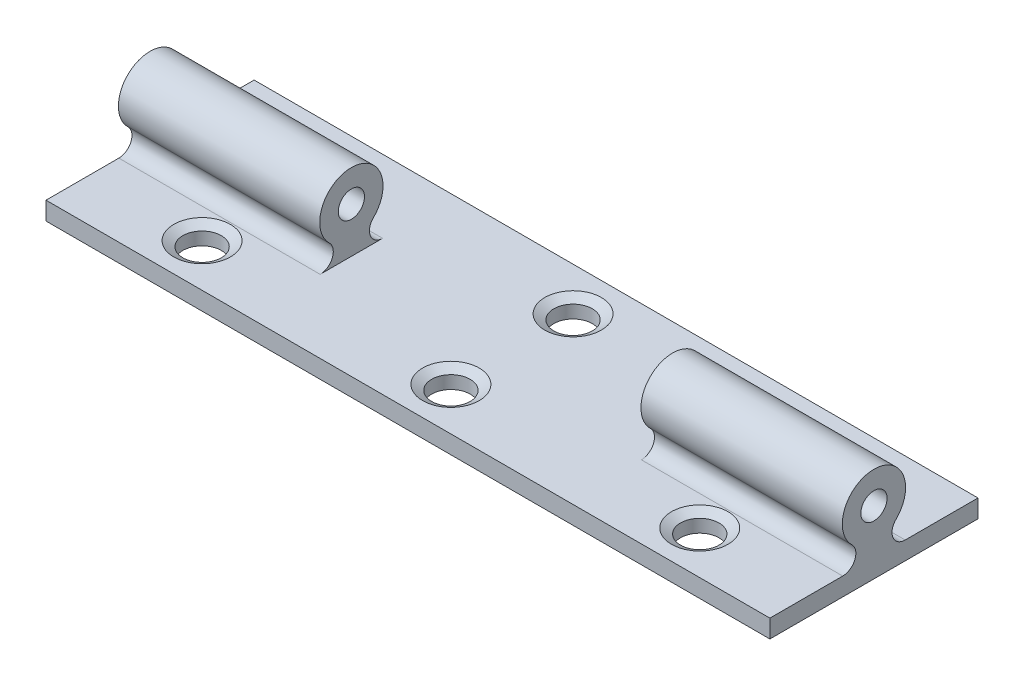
ISO-10303-21;
HEADER;
FILE_DESCRIPTION(('STEP AP214'),'2;1');
FILE_NAME('part.step','',(''),(''),'','','');
FILE_SCHEMA(('AUTOMOTIVE_DESIGN { 1 0 10303 214 1 1 1 1 }'));
ENDSEC;
DATA;
#1=APPLICATION_CONTEXT('core data for automotive mechanical design processes');
#2=APPLICATION_PROTOCOL_DEFINITION('international standard','automotive_design',2000,#1);
#3=PRODUCT_CONTEXT('',#1,'mechanical');
#4=PRODUCT('Part','Part','',(#3));
#5=PRODUCT_RELATED_PRODUCT_CATEGORY('part','',(#4));
#6=PRODUCT_DEFINITION_FORMATION('','',#4);
#7=PRODUCT_DEFINITION_CONTEXT('part definition',#1,'design');
#8=PRODUCT_DEFINITION('design','',#6,#7);
#9=PRODUCT_DEFINITION_SHAPE('','',#8);
#10=(LENGTH_UNIT() NAMED_UNIT(*) SI_UNIT(.MILLI.,.METRE.));
#11=(NAMED_UNIT(*) PLANE_ANGLE_UNIT() SI_UNIT($,.RADIAN.));
#12=(NAMED_UNIT(*) SI_UNIT($,.STERADIAN.) SOLID_ANGLE_UNIT());
#13=UNCERTAINTY_MEASURE_WITH_UNIT(LENGTH_MEASURE(1.E-05),#10,'distance_accuracy_value','');
#14=(GEOMETRIC_REPRESENTATION_CONTEXT(3) GLOBAL_UNCERTAINTY_ASSIGNED_CONTEXT((#13)) GLOBAL_UNIT_ASSIGNED_CONTEXT((#10,
#11,#12)) REPRESENTATION_CONTEXT('',''));
#15=CARTESIAN_POINT('',(0.,0.,0.));
#16=DIRECTION('',(0.,0.,1.));
#17=DIRECTION('',(1.,0.,0.));
#18=AXIS2_PLACEMENT_3D('',#15,#16,#17);
#19=CARTESIAN_POINT('',(-44.45,2.,-3.45024753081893));
#20=CARTESIAN_POINT('',(-42.9666666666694,2.,-3.45024753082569));
#21=CARTESIAN_POINT('',(-41.4833333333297,2.,-3.45024753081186));
#22=CARTESIAN_POINT('',(-32.5833333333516,2.,-3.45024753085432));
#23=CARTESIAN_POINT('',(-25.1666666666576,2.,-3.45024753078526));
#24=CARTESIAN_POINT('',(-10.3333333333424,2.,-3.45024753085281));
#25=CARTESIAN_POINT('',(-2.91666666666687,2.,-3.45024753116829));
#26=CARTESIAN_POINT('',(5.98333333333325,2.,-3.4502475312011));
#27=CARTESIAN_POINT('',(7.46666666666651,2.,-3.45024753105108));
#28=CARTESIAN_POINT('',(8.94999999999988,2.,-3.45024753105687));
#29=CARTESIAN_POINT('',(-44.45,2.,-1.91645860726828));
#30=CARTESIAN_POINT('',(-42.9666666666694,1.99999999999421,-1.91645860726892));
#31=CARTESIAN_POINT('',(-41.4833333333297,2.00000000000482,-1.91645860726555));
#32=CARTESIAN_POINT('',(-32.5833333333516,1.99999999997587,-1.91645860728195));
#33=CARTESIAN_POINT('',(-25.1666666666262,2.00000000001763,-1.91645860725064));
#34=CARTESIAN_POINT('',(-10.333333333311,1.99999999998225,-1.91645860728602));
#35=CARTESIAN_POINT('',(-2.9166666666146,1.99999999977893,-1.91645860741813));
#36=CARTESIAN_POINT('',(5.98333333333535,1.99999999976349,-1.91645860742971));
#37=CARTESIAN_POINT('',(7.46666666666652,1.99999999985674,-1.91645860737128));
#38=CARTESIAN_POINT('',(8.94999999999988,1.99999999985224,-1.91645860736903));
#39=CARTESIAN_POINT('',(-44.45,3.42117187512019,-1.33958863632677));
#40=CARTESIAN_POINT('',(-42.9666666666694,3.42117187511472,-1.33958863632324));
#41=CARTESIAN_POINT('',(-41.4833333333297,3.42117187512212,-1.33958863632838));
#42=CARTESIAN_POINT('',(-32.5833333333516,3.42117187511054,-1.33958863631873));
#43=CARTESIAN_POINT('',(-25.1666666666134,3.42117187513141,-1.33958863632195));
#44=CARTESIAN_POINT('',(-10.3333333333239,3.4211718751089,-1.3395886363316));
#45=CARTESIAN_POINT('',(-2.91666666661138,3.42117187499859,-1.33958863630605));
#46=CARTESIAN_POINT('',(5.9833333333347,3.42117187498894,-1.33958863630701));
#47=CARTESIAN_POINT('',(7.466666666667,3.42117187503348,-1.33958863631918));
#48=CARTESIAN_POINT('',(8.94999999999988,3.4211718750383,-1.3395886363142));
#49=CARTESIAN_POINT('',(-44.45,4.49019951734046,-2.43944697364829));
#50=CARTESIAN_POINT('',(-42.9666666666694,4.49019951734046,-2.43944697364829));
#51=CARTESIAN_POINT('',(-41.4833333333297,4.49019951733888,-2.43944697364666));
#52=CARTESIAN_POINT('',(-32.5833333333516,4.49019951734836,-2.43944697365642));
#53=CARTESIAN_POINT('',(-25.1666666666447,4.49019951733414,-2.43944697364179));
#54=CARTESIAN_POINT('',(-10.3333333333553,4.49019951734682,-2.43944697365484));
#55=CARTESIAN_POINT('',(-2.91666666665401,4.49019951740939,-2.43944697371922));
#56=CARTESIAN_POINT('',(5.98333333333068,4.4901995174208,-2.43944697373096));
#57=CARTESIAN_POINT('',(7.46666666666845,4.49019951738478,-2.4394469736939));
#58=CARTESIAN_POINT('',(8.94999999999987,4.49019951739,-2.43944697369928));
#59=(BOUNDED_SURFACE() B_SPLINE_SURFACE(3,3,((#19,#20,#21,#22,#23,#24,#25,#26,#27,#28),(#29,#30,
#31,#32,#33,#34,#35,#36,#37,#38),(#39,#40,#41,#42,#43,#44,#45,#46,#47,#48),(#49,#50,#51,#52,#53,
#54,#55,#56,#57,#58)),.UNSPECIFIED.,.F.,.F.,.F.) B_SPLINE_SURFACE_WITH_KNOTS((4,4),(4,2,2,2,4),
(0.,1.),(-0.199999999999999,0.,0.999999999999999,2.,2.2),
.UNSPECIFIED.) GEOMETRIC_REPRESENTATION_ITEM() RATIONAL_B_SPLINE_SURFACE(((1.,1.,1.,1.,1.,1.,1.,
1.,1.,1.),(0.584071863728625,0.584071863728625,0.584071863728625,0.584071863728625,
0.584071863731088,0.584071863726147,0.584071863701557,0.584071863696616,0.584071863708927,
0.584071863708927),(0.584071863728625,0.584071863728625,0.584071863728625,0.584071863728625,
0.584071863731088,0.584071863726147,0.584071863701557,0.584071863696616,0.584071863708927,
0.584071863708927),(1.,1.,1.,1.,1.,1.,1.,1.,1.,1.))) REPRESENTATION_ITEM('') SURFACE());
#60=CARTESIAN_POINT('',(8.94999999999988,2.,-3.45024753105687));
#61=CARTESIAN_POINT('',(7.46666666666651,2.,-3.45024753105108));
#62=CARTESIAN_POINT('',(5.98333333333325,2.,-3.4502475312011));
#63=CARTESIAN_POINT('',(-2.91666666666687,2.,-3.45024753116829));
#64=CARTESIAN_POINT('',(-10.3333333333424,2.,-3.45024753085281));
#65=CARTESIAN_POINT('',(-25.1666666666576,2.,-3.45024753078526));
#66=CARTESIAN_POINT('',(-32.5833333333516,2.,-3.45024753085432));
#67=CARTESIAN_POINT('',(-41.4833333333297,2.,-3.45024753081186));
#68=CARTESIAN_POINT('',(-42.9666666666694,2.,-3.45024753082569));
#69=CARTESIAN_POINT('',(-44.45,2.,-3.45024753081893));
#70=(BOUNDED_CURVE() B_SPLINE_CURVE(3,(#60,#61,#62,#63,#64,#65,#66,#67,#68,#69),.UNSPECIFIED.,
.F.,.F.) B_SPLINE_CURVE_WITH_KNOTS((4,2,2,2,4),(-0.199999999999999,0.,1.,2.,2.2),
.UNSPECIFIED.) CURVE() GEOMETRIC_REPRESENTATION_ITEM() RATIONAL_B_SPLINE_CURVE((1.,1.,1.,1.,1.,
1.,1.,1.,1.,1.)) REPRESENTATION_ITEM(''));
#71=CARTESIAN_POINT('',(-40.,2.,-3.45024753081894));
#72=VERTEX_POINT('',#71);
#73=CARTESIAN_POINT('',(-17.75,2.,-3.45024753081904));
#74=VERTEX_POINT('',#73);
#75=EDGE_CURVE('E193',#72,#74,#70,.F.);
#76=CARTESIAN_POINT('',(-40.,2.,-3.45024753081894));
#77=CARTESIAN_POINT('',(-40.,2.,-1.91645860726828));
#78=CARTESIAN_POINT('',(-40.,3.42117187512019,-1.33958863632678));
#79=CARTESIAN_POINT('',(-40.,4.49019951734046,-2.43944697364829));
#80=(BOUNDED_CURVE() B_SPLINE_CURVE(3,(#76,#77,#78,#79),.UNSPECIFIED.,.F.,
.F.) B_SPLINE_CURVE_WITH_KNOTS((4,4),(0.,1.),
.UNSPECIFIED.) CURVE() GEOMETRIC_REPRESENTATION_ITEM() RATIONAL_B_SPLINE_CURVE((1.,
0.584071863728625,0.584071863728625,1.)) REPRESENTATION_ITEM(''));
#81=CARTESIAN_POINT('',(-40.,4.49019951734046,-2.43944697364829));
#82=VERTEX_POINT('',#81);
#83=EDGE_CURVE('E59',#72,#82,#80,.T.);
#84=CARTESIAN_POINT('',(-44.45,4.49019951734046,-2.43944697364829));
#85=CARTESIAN_POINT('',(-42.9666666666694,4.49019951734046,-2.43944697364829));
#86=CARTESIAN_POINT('',(-41.4833333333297,4.49019951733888,-2.43944697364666));
#87=CARTESIAN_POINT('',(-32.5833333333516,4.49019951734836,-2.43944697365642));
#88=CARTESIAN_POINT('',(-25.1666666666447,4.49019951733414,-2.43944697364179));
#89=CARTESIAN_POINT('',(-10.3333333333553,4.49019951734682,-2.43944697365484));
#90=CARTESIAN_POINT('',(-2.91666666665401,4.49019951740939,-2.43944697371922));
#91=CARTESIAN_POINT('',(5.98333333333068,4.4901995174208,-2.43944697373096));
#92=CARTESIAN_POINT('',(7.46666666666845,4.49019951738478,-2.4394469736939));
#93=CARTESIAN_POINT('',(8.94999999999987,4.49019951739,-2.43944697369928));
#94=(BOUNDED_CURVE() B_SPLINE_CURVE(3,(#84,#85,#86,#87,#88,#89,#90,#91,#92,#93),.UNSPECIFIED.,
.F.,.F.) B_SPLINE_CURVE_WITH_KNOTS((4,2,2,2,4),(-0.199999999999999,0.,0.999999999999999,2.,2.2),
.UNSPECIFIED.) CURVE() GEOMETRIC_REPRESENTATION_ITEM() RATIONAL_B_SPLINE_CURVE((1.,1.,1.,1.,1.,
1.,1.,1.,1.,1.)) REPRESENTATION_ITEM(''));
#95=CARTESIAN_POINT('',(-17.75,4.49019951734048,-2.43944697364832));
#96=VERTEX_POINT('',#95);
#97=EDGE_CURVE('E860',#96,#82,#94,.F.);
#98=CARTESIAN_POINT('',(-17.75,4.49019951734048,-2.43944697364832));
#99=CARTESIAN_POINT('',(-17.75,3.42117187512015,-1.33958863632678));
#100=CARTESIAN_POINT('',(-17.75,1.99999999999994,-1.91645860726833));
#101=CARTESIAN_POINT('',(-17.75,2.,-3.45024753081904));
#102=(BOUNDED_CURVE() B_SPLINE_CURVE(3,(#98,#99,#100,#101),.UNSPECIFIED.,.F.,
.F.) B_SPLINE_CURVE_WITH_KNOTS((4,4),(0.,1.),
.UNSPECIFIED.) CURVE() GEOMETRIC_REPRESENTATION_ITEM() RATIONAL_B_SPLINE_CURVE((1.,
0.584071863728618,0.584071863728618,1.)) REPRESENTATION_ITEM(''));
#103=EDGE_CURVE('E51',#74,#96,#102,.F.);
#104=ORIENTED_EDGE('',*,*,#75,.F.);
#105=ORIENTED_EDGE('',*,*,#83,.T.);
#106=ORIENTED_EDGE('',*,*,#97,.F.);
#107=ORIENTED_EDGE('',*,*,#103,.F.);
#108=EDGE_LOOP('',(#104,#105,#106,#107));
#109=FACE_BOUND('',#108,.T.);
#110=ADVANCED_FACE('F35',(#109),#59,.T.);
#111=CARTESIAN_POINT('',(-8.95000000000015,2.,-3.45024753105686));
#112=CARTESIAN_POINT('',(-7.46666666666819,2.,-3.45024753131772));
#113=CARTESIAN_POINT('',(-5.98333333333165,2.,-3.45024753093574));
#114=CARTESIAN_POINT('',(2.91666666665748,2.,-3.45024753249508));
#115=CARTESIAN_POINT('',(10.333333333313,2.,-3.45024752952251));
#116=CARTESIAN_POINT('',(25.166666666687,2.,-3.45024753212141));
#117=CARTESIAN_POINT('',(32.5833333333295,2.,-3.45024754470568));
#118=CARTESIAN_POINT('',(41.4833333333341,2.,-3.45024754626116));
#119=CARTESIAN_POINT('',(42.9666666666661,2.,-3.45024754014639));
#120=CARTESIAN_POINT('',(44.45,2.,-3.45024754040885));
#121=CARTESIAN_POINT('',(-8.95000000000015,1.99999999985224,-1.91645860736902));
#122=CARTESIAN_POINT('',(-7.46666666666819,1.99999999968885,-1.91645860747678));
#123=CARTESIAN_POINT('',(-5.98333333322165,1.99999999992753,-1.9164586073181));
#124=CARTESIAN_POINT('',(2.91666666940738,1.99999999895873,-1.91645860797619));
#125=CARTESIAN_POINT('',(10.3333333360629,2.00000000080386,-1.91645860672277));
#126=CARTESIAN_POINT('',(25.1666666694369,1.99999999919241,-1.91645860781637));
#127=CARTESIAN_POINT('',(32.5833333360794,1.99999999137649,-1.91645861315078));
#128=CARTESIAN_POINT('',(41.4833333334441,1.99999999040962,-1.91645861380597));
#129=CARTESIAN_POINT('',(42.9666666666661,1.99999999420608,-1.91645861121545));
#130=CARTESIAN_POINT('',(44.45,1.99999999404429,-1.91645861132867));
#131=CARTESIAN_POINT('',(-8.95000000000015,3.4211718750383,-1.33958863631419));
#132=CARTESIAN_POINT('',(-7.46666666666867,3.42117187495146,-1.33958863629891));
#133=CARTESIAN_POINT('',(-5.98333333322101,3.421171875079,-1.33958863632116));
#134=CARTESIAN_POINT('',(2.91666666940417,3.42117187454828,-1.33958863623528));
#135=CARTESIAN_POINT('',(10.3333333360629,3.42117187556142,-1.3395886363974));
#136=CARTESIAN_POINT('',(25.1666666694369,3.42117187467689,-1.33958863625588));
#137=CARTESIAN_POINT('',(32.5833333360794,3.4211718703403,-1.33958863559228));
#138=CARTESIAN_POINT('',(41.4833333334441,3.42117186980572,-1.3395886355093));
#139=CARTESIAN_POINT('',(42.9666666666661,3.42117187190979,-1.33958863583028));
#140=CARTESIAN_POINT('',(44.45,3.42117187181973,-1.33958863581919));
#141=CARTESIAN_POINT('',(-8.95000000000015,4.49019951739,-2.43944697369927));
#142=CARTESIAN_POINT('',(-7.46666666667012,4.49019951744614,-2.43944697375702));
#143=CARTESIAN_POINT('',(-5.98333333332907,4.4901995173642,-2.43944697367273));
#144=CARTESIAN_POINT('',(2.91666666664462,4.49019951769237,-2.43944697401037));
#145=CARTESIAN_POINT('',(10.3333333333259,4.49019951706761,-2.43944697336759));
#146=CARTESIAN_POINT('',(25.1666666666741,4.49019951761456,-2.43944697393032));
#147=CARTESIAN_POINT('',(32.5833333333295,4.4901995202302,-2.43944697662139));
#148=CARTESIAN_POINT('',(41.4833333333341,4.49019952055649,-2.4394469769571));
#149=CARTESIAN_POINT('',(42.9666666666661,4.49019951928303,-2.43944697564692));
#150=CARTESIAN_POINT('',(44.45,4.49019951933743,-2.43944697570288));
#151=(BOUNDED_SURFACE() B_SPLINE_SURFACE(3,3,((#111,#112,#113,#114,#115,#116,#117,#118,#119,
#120),(#121,#122,#123,#124,#125,#126,#127,#128,#129,#130),(#131,#132,#133,#134,#135,#136,#137,
#138,#139,#140),(#141,#142,#143,#144,#145,#146,#147,#148,#149,#150)),.UNSPECIFIED.,.F.,.F.,
.F.) B_SPLINE_SURFACE_WITH_KNOTS((4,4),(4,2,2,2,4),(0.,1.),(-1.2,-1.,0.,1.,1.2),
.UNSPECIFIED.) GEOMETRIC_REPRESENTATION_ITEM() RATIONAL_B_SPLINE_SURFACE(((1.,1.,1.,1.,1.,1.,1.,
1.,1.,1.),(0.584071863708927,0.584071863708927,0.584071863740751,0.584071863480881,
0.584071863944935,0.584071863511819,0.584071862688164,0.584071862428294,0.584071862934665,
0.584071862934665),(0.584071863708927,0.584071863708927,0.584071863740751,0.584071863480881,
0.584071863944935,0.584071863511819,0.584071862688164,0.584071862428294,0.584071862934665,
0.584071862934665),(1.,1.,1.,1.,1.,1.,1.,1.,1.,1.))) REPRESENTATION_ITEM('') SURFACE());
#152=CARTESIAN_POINT('',(44.45,2.,-3.45024754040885));
#153=CARTESIAN_POINT('',(42.9666666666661,2.,-3.45024754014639));
#154=CARTESIAN_POINT('',(41.4833333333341,2.,-3.45024754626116));
#155=CARTESIAN_POINT('',(32.5833333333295,2.,-3.45024754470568));
#156=CARTESIAN_POINT('',(25.166666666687,2.,-3.45024753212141));
#157=CARTESIAN_POINT('',(10.333333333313,2.,-3.45024752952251));
#158=CARTESIAN_POINT('',(2.91666666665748,2.,-3.45024753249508));
#159=CARTESIAN_POINT('',(-5.98333333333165,2.,-3.45024753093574));
#160=CARTESIAN_POINT('',(-7.46666666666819,2.,-3.45024753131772));
#161=CARTESIAN_POINT('',(-8.95000000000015,2.,-3.45024753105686));
#162=(BOUNDED_CURVE() B_SPLINE_CURVE(3,(#152,#153,#154,#155,#156,#157,#158,#159,#160,#161),
.UNSPECIFIED.,.F.,.F.) B_SPLINE_CURVE_WITH_KNOTS((4,2,2,2,4),(-1.2,-1.,0.,1.,1.2),
.UNSPECIFIED.) CURVE() GEOMETRIC_REPRESENTATION_ITEM() RATIONAL_B_SPLINE_CURVE((1.,1.,1.,1.,1.,
1.,1.,1.,1.,1.)) REPRESENTATION_ITEM(''));
#163=CARTESIAN_POINT('',(17.75,2.,-3.45024753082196));
#164=VERTEX_POINT('',#163);
#165=CARTESIAN_POINT('',(40.,2.,-3.45024754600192));
#166=VERTEX_POINT('',#165);
#167=EDGE_CURVE('E135',#164,#166,#162,.F.);
#168=CARTESIAN_POINT('',(17.75,2.,-3.45024753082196));
#169=CARTESIAN_POINT('',(17.75,1.99999999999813,-1.91645860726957));
#170=CARTESIAN_POINT('',(17.75,3.42117187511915,-1.33958863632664));
#171=CARTESIAN_POINT('',(17.75,4.49019951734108,-2.43944697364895));
#172=(BOUNDED_CURVE() B_SPLINE_CURVE(3,(#168,#169,#170,#171),.UNSPECIFIED.,.F.,
.F.) B_SPLINE_CURVE_WITH_KNOTS((4,4),(0.,1.),
.UNSPECIFIED.) CURVE() GEOMETRIC_REPRESENTATION_ITEM() RATIONAL_B_SPLINE_CURVE((1.,
0.584071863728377,0.584071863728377,1.)) REPRESENTATION_ITEM(''));
#173=CARTESIAN_POINT('',(17.75,4.49019951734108,-2.43944697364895));
#174=VERTEX_POINT('',#173);
#175=EDGE_CURVE('E862',#174,#164,#172,.F.);
#176=CARTESIAN_POINT('',(-8.95000000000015,4.49019951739,-2.43944697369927));
#177=CARTESIAN_POINT('',(-7.46666666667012,4.49019951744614,-2.43944697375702));
#178=CARTESIAN_POINT('',(-5.98333333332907,4.4901995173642,-2.43944697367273));
#179=CARTESIAN_POINT('',(2.91666666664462,4.49019951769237,-2.43944697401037));
#180=CARTESIAN_POINT('',(10.3333333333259,4.49019951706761,-2.43944697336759));
#181=CARTESIAN_POINT('',(25.1666666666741,4.49019951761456,-2.43944697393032));
#182=CARTESIAN_POINT('',(32.5833333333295,4.4901995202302,-2.43944697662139));
#183=CARTESIAN_POINT('',(41.4833333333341,4.49019952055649,-2.4394469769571));
#184=CARTESIAN_POINT('',(42.9666666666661,4.49019951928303,-2.43944697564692));
#185=CARTESIAN_POINT('',(44.45,4.49019951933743,-2.43944697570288));
#186=(BOUNDED_CURVE() B_SPLINE_CURVE(3,(#176,#177,#178,#179,#180,#181,#182,#183,#184,#185),
.UNSPECIFIED.,.F.,.F.) B_SPLINE_CURVE_WITH_KNOTS((4,2,2,2,4),(-1.2,-1.,0.,1.,1.2),
.UNSPECIFIED.) CURVE() GEOMETRIC_REPRESENTATION_ITEM() RATIONAL_B_SPLINE_CURVE((1.,1.,1.,1.,1.,
1.,1.,1.,1.,1.)) REPRESENTATION_ITEM(''));
#187=CARTESIAN_POINT('',(40.,4.49019952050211,-2.43944697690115));
#188=VERTEX_POINT('',#187);
#189=EDGE_CURVE('E866',#188,#174,#186,.F.);
#190=CARTESIAN_POINT('',(40.,4.49019952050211,-2.43944697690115));
#191=CARTESIAN_POINT('',(40.,3.42117186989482,-1.33958863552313));
#192=CARTESIAN_POINT('',(40.,1.99999999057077,-1.91645861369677));
#193=CARTESIAN_POINT('',(40.,2.,-3.45024754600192));
#194=(BOUNDED_CURVE() B_SPLINE_CURVE(3,(#190,#191,#192,#193),.UNSPECIFIED.,.F.,
.F.) B_SPLINE_CURVE_WITH_KNOTS((4,4),(0.,1.),
.UNSPECIFIED.) CURVE() GEOMETRIC_REPRESENTATION_ITEM() RATIONAL_B_SPLINE_CURVE((1.,
0.584071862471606,0.584071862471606,1.)) REPRESENTATION_ITEM(''));
#195=EDGE_CURVE('E861',#188,#166,#194,.T.);
#196=ORIENTED_EDGE('',*,*,#167,.F.);
#197=ORIENTED_EDGE('',*,*,#175,.F.);
#198=ORIENTED_EDGE('',*,*,#189,.F.);
#199=ORIENTED_EDGE('',*,*,#195,.T.);
#200=EDGE_LOOP('',(#196,#197,#198,#199));
#201=FACE_BOUND('',#200,.T.);
#202=ADVANCED_FACE('F372',(#201),#151,.T.);
#203=CARTESIAN_POINT('',(-8.95000000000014,4.49019951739,2.43944697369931));
#204=CARTESIAN_POINT('',(-7.46666666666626,4.49019951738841,2.43944697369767));
#205=CARTESIAN_POINT('',(-5.98333333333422,4.49019951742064,2.43944697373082));
#206=CARTESIAN_POINT('',(2.91666666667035,4.49019951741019,2.43944697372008));
#207=CARTESIAN_POINT('',(10.3333333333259,4.49019951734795,2.43944697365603));
#208=CARTESIAN_POINT('',(25.1666666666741,4.49019951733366,2.43944697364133));
#209=CARTESIAN_POINT('',(32.5833333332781,4.4901995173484,2.43944697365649));
#210=CARTESIAN_POINT('',(41.4833333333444,4.49019951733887,2.43944697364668));
#211=CARTESIAN_POINT('',(42.9666666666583,4.49019951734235,2.43944697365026));
#212=CARTESIAN_POINT('',(44.45,4.49019951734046,2.43944697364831));
#213=CARTESIAN_POINT('',(-8.95000000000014,3.4211718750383,1.33958863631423));
#214=CARTESIAN_POINT('',(-7.46666666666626,3.42117187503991,1.33958863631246));
#215=CARTESIAN_POINT('',(-5.98333333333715,3.42117187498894,1.33958863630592));
#216=CARTESIAN_POINT('',(2.91666666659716,3.42117187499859,1.33958863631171));
#217=CARTESIAN_POINT('',(10.3333333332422,3.42117187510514,1.33958863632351));
#218=CARTESIAN_POINT('',(25.1666666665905,3.42117187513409,1.33958863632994));
#219=CARTESIAN_POINT('',(32.5833333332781,3.42117187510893,1.33958863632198));
#220=CARTESIAN_POINT('',(41.4833333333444,3.42117187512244,1.33958863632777));
#221=CARTESIAN_POINT('',(42.9666666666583,3.42117187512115,1.33958863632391));
#222=CARTESIAN_POINT('',(44.45,3.42117187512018,1.3395886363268));
#223=CARTESIAN_POINT('',(-8.95000000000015,1.99999999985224,1.91645860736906));
#224=CARTESIAN_POINT('',(-7.46666666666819,1.99999999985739,1.91645860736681));
#225=CARTESIAN_POINT('',(-5.98333333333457,1.99999999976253,1.91645860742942));
#226=CARTESIAN_POINT('',(2.9166666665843,1.99999999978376,1.91645860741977));
#227=CARTESIAN_POINT('',(10.3333333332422,1.99999999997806,1.91645860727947));
#228=CARTESIAN_POINT('',(25.1666666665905,2.00000000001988,1.91645860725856));
#229=CARTESIAN_POINT('',(32.5833333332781,1.99999999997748,1.91645860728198));
#230=CARTESIAN_POINT('',(41.4833333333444,2.0000000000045,1.91645860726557));
#231=CARTESIAN_POINT('',(42.9666666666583,2.,1.91645860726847));
#232=CARTESIAN_POINT('',(44.45,2.,1.91645860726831));
#233=CARTESIAN_POINT('',(-8.95000000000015,2.,3.4502475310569));
#234=CARTESIAN_POINT('',(-7.46666666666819,2.,3.45024753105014));
#235=CARTESIAN_POINT('',(-5.98333333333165,2.,3.45024753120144));
#236=CARTESIAN_POINT('',(2.91666666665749,2.,3.45024753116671));
#237=CARTESIAN_POINT('',(10.3333333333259,2.,3.45024753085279));
#238=CARTESIAN_POINT('',(25.1666666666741,2.,3.45024753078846));
#239=CARTESIAN_POINT('',(32.5833333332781,2.,3.45024753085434));
#240=CARTESIAN_POINT('',(41.4833333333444,2.,3.45024753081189));
#241=CARTESIAN_POINT('',(42.9666666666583,2.,3.45024753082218));
#242=CARTESIAN_POINT('',(44.45,2.,3.45024753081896));
#243=(BOUNDED_SURFACE() B_SPLINE_SURFACE(3,3,((#203,#204,#205,#206,#207,#208,#209,#210,#211,
#212),(#213,#214,#215,#216,#217,#218,#219,#220,#221,#222),(#223,#224,#225,#226,#227,#228,#229,
#230,#231,#232),(#233,#234,#235,#236,#237,#238,#239,#240,#241,#242)),.UNSPECIFIED.,.F.,.F.,
.F.) B_SPLINE_SURFACE_WITH_KNOTS((4,4),(4,2,2,2,4),(0.,1.),(-1.2,-1.,0.,1.,1.2),
.UNSPECIFIED.) GEOMETRIC_REPRESENTATION_ITEM() RATIONAL_B_SPLINE_SURFACE(((1.,1.,1.,1.,1.,1.,1.,
1.,1.,1.),(0.584071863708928,0.584071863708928,0.584071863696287,0.584071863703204,
0.584071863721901,0.584071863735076,0.584071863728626,0.584071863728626,0.584071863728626,
0.584071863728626),(0.584071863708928,0.584071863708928,0.584071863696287,0.584071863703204,
0.584071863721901,0.584071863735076,0.584071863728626,0.584071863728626,0.584071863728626,
0.584071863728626),(1.,1.,1.,1.,1.,1.,1.,1.,1.,1.))) REPRESENTATION_ITEM('') SURFACE());
#244=CARTESIAN_POINT('',(-8.95000000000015,2.,3.4502475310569));
#245=CARTESIAN_POINT('',(-7.46666666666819,2.,3.45024753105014));
#246=CARTESIAN_POINT('',(-5.98333333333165,2.,3.45024753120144));
#247=CARTESIAN_POINT('',(2.91666666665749,2.,3.45024753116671));
#248=CARTESIAN_POINT('',(10.3333333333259,2.,3.45024753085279));
#249=CARTESIAN_POINT('',(25.1666666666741,2.,3.45024753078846));
#250=CARTESIAN_POINT('',(32.5833333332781,2.,3.45024753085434));
#251=CARTESIAN_POINT('',(41.4833333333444,2.,3.45024753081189));
#252=CARTESIAN_POINT('',(42.9666666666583,2.,3.45024753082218));
#253=CARTESIAN_POINT('',(44.45,2.,3.45024753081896));
#254=(BOUNDED_CURVE() B_SPLINE_CURVE(3,(#244,#245,#246,#247,#248,#249,#250,#251,#252,#253),
.UNSPECIFIED.,.F.,.F.) B_SPLINE_CURVE_WITH_KNOTS((4,2,2,2,4),(-1.2,-1.,0.,1.,1.2),
.UNSPECIFIED.) CURVE() GEOMETRIC_REPRESENTATION_ITEM() RATIONAL_B_SPLINE_CURVE((1.,1.,1.,1.,1.,
1.,1.,1.,1.,1.)) REPRESENTATION_ITEM(''));
#255=CARTESIAN_POINT('',(40.,2.,3.45024753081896));
#256=VERTEX_POINT('',#255);
#257=CARTESIAN_POINT('',(17.75,2.,3.45024753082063));
#258=VERTEX_POINT('',#257);
#259=EDGE_CURVE('E512',#256,#258,#254,.F.);
#260=CARTESIAN_POINT('',(40.,2.,3.45024753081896));
#261=CARTESIAN_POINT('',(40.,2.,1.91645860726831));
#262=CARTESIAN_POINT('',(40.,3.42117187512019,1.33958863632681));
#263=CARTESIAN_POINT('',(40.,4.49019951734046,2.43944697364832));
#264=(BOUNDED_CURVE() B_SPLINE_CURVE(3,(#260,#261,#262,#263),.UNSPECIFIED.,.F.,
.F.) B_SPLINE_CURVE_WITH_KNOTS((4,4),(0.,1.),
.UNSPECIFIED.) CURVE() GEOMETRIC_REPRESENTATION_ITEM() RATIONAL_B_SPLINE_CURVE((1.,
0.584071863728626,0.584071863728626,1.)) REPRESENTATION_ITEM(''));
#265=CARTESIAN_POINT('',(40.,4.49019951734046,2.43944697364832));
#266=VERTEX_POINT('',#265);
#267=EDGE_CURVE('E456',#256,#266,#264,.T.);
#268=CARTESIAN_POINT('',(44.45,4.49019951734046,2.43944697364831));
#269=CARTESIAN_POINT('',(42.9666666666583,4.49019951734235,2.43944697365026));
#270=CARTESIAN_POINT('',(41.4833333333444,4.49019951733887,2.43944697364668));
#271=CARTESIAN_POINT('',(32.5833333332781,4.4901995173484,2.43944697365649));
#272=CARTESIAN_POINT('',(25.1666666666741,4.49019951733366,2.43944697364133));
#273=CARTESIAN_POINT('',(10.3333333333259,4.49019951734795,2.43944697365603));
#274=CARTESIAN_POINT('',(2.91666666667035,4.49019951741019,2.43944697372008));
#275=CARTESIAN_POINT('',(-5.98333333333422,4.49019951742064,2.43944697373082));
#276=CARTESIAN_POINT('',(-7.46666666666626,4.49019951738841,2.43944697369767));
#277=CARTESIAN_POINT('',(-8.95000000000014,4.49019951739,2.43944697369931));
#278=(BOUNDED_CURVE() B_SPLINE_CURVE(3,(#268,#269,#270,#271,#272,#273,#274,#275,#276,#277),
.UNSPECIFIED.,.F.,.F.) B_SPLINE_CURVE_WITH_KNOTS((4,2,2,2,4),(-1.2,-1.,0.,1.,1.2),
.UNSPECIFIED.) CURVE() GEOMETRIC_REPRESENTATION_ITEM() RATIONAL_B_SPLINE_CURVE((1.,1.,1.,1.,1.,
1.,1.,1.,1.,1.)) REPRESENTATION_ITEM(''));
#279=CARTESIAN_POINT('',(17.75,4.4901995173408,2.43944697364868));
#280=VERTEX_POINT('',#279);
#281=EDGE_CURVE('E480',#280,#266,#278,.F.);
#282=CARTESIAN_POINT('',(17.75,4.4901995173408,2.43944697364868));
#283=CARTESIAN_POINT('',(17.75,3.42117187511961,1.33958863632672));
#284=CARTESIAN_POINT('',(17.75,1.99999999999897,1.91645860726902));
#285=CARTESIAN_POINT('',(17.75,2.,3.45024753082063));
#286=(BOUNDED_CURVE() B_SPLINE_CURVE(3,(#282,#283,#284,#285),.UNSPECIFIED.,.F.,
.F.) B_SPLINE_CURVE_WITH_KNOTS((4,4),(0.,1.),
.UNSPECIFIED.) CURVE() GEOMETRIC_REPRESENTATION_ITEM() RATIONAL_B_SPLINE_CURVE((1.,
0.584071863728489,0.584071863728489,1.)) REPRESENTATION_ITEM(''));
#287=EDGE_CURVE('E491',#258,#280,#286,.F.);
#288=ORIENTED_EDGE('',*,*,#259,.F.);
#289=ORIENTED_EDGE('',*,*,#267,.T.);
#290=ORIENTED_EDGE('',*,*,#281,.F.);
#291=ORIENTED_EDGE('',*,*,#287,.F.);
#292=EDGE_LOOP('',(#288,#289,#290,#291));
#293=FACE_BOUND('',#292,.T.);
#294=ADVANCED_FACE('F292',(#293),#243,.T.);
#295=CARTESIAN_POINT('',(-44.45,4.49019951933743,2.43944697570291));
#296=CARTESIAN_POINT('',(-42.9666666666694,4.4901995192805,2.43944697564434));
#297=CARTESIAN_POINT('',(-41.4833333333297,4.49019952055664,2.43944697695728));
#298=CARTESIAN_POINT('',(-32.5833333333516,4.49019952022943,2.43944697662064));
#299=CARTESIAN_POINT('',(-25.1666666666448,4.49019951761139,2.43944697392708));
#300=CARTESIAN_POINT('',(-10.3333333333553,4.49019951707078,2.43944697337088));
#301=CARTESIAN_POINT('',(-2.91666666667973,4.49019951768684,2.4394469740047));
#302=CARTESIAN_POINT('',(5.98333333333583,4.49019951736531,2.4394469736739));
#303=CARTESIAN_POINT('',(7.46666666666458,4.49019951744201,2.43944697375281));
#304=CARTESIAN_POINT('',(8.94999999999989,4.49019951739,2.4394469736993));
#305=CARTESIAN_POINT('',(-44.45,3.42117187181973,1.33958863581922));
#306=CARTESIAN_POINT('',(-42.9666666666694,3.42117187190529,1.33958863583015));
#307=CARTESIAN_POINT('',(-41.4833333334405,3.42117186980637,1.3395886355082));
#308=CARTESIAN_POINT('',(-32.5833333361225,3.42117187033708,1.33958863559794));
#309=CARTESIAN_POINT('',(-25.1666666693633,3.42117187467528,1.33958863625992));
#310=CARTESIAN_POINT('',(-10.3333333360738,3.42117187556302,1.33958863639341));
#311=CARTESIAN_POINT('',(-2.91666666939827,3.42117187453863,1.33958863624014));
#312=CARTESIAN_POINT('',(5.98333333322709,3.42117187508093,1.33958863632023));
#313=CARTESIAN_POINT('',(7.46666666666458,3.4211718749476,1.33958863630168));
#314=CARTESIAN_POINT('',(8.94999999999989,3.4211718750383,1.33958863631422));
#315=CARTESIAN_POINT('',(-44.45,1.99999999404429,1.9164586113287));
#316=CARTESIAN_POINT('',(-42.9666666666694,1.99999999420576,1.91645861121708));
#317=CARTESIAN_POINT('',(-41.4833333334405,1.9999999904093,1.91645861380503));
#318=CARTESIAN_POINT('',(-32.5833333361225,1.9999999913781,1.91645861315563));
#319=CARTESIAN_POINT('',(-25.1666666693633,1.99999999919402,1.91645860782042));
#320=CARTESIAN_POINT('',(-10.3333333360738,2.00000000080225,1.91645860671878));
#321=CARTESIAN_POINT('',(-2.9166666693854,1.99999999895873,1.91645860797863));
#322=CARTESIAN_POINT('',(5.98333333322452,1.99999999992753,1.91645860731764));
#323=CARTESIAN_POINT('',(7.46666666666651,1.99999999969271,1.91645860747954));
#324=CARTESIAN_POINT('',(8.94999999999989,1.99999999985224,1.91645860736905));
#325=CARTESIAN_POINT('',(-44.45,2.,3.45024754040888));
#326=CARTESIAN_POINT('',(-42.9666666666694,2.,3.4502475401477));
#327=CARTESIAN_POINT('',(-41.4833333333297,2.,3.45024754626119));
#328=CARTESIAN_POINT('',(-32.5833333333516,2.,3.4502475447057));
#329=CARTESIAN_POINT('',(-25.1666666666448,2.,3.45024753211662));
#330=CARTESIAN_POINT('',(-10.3333333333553,2.,3.45024752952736));
#331=CARTESIAN_POINT('',(-2.91666666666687,2.,3.4502475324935));
#332=CARTESIAN_POINT('',(5.98333333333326,2.,3.45024753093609));
#333=CARTESIAN_POINT('',(7.46666666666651,2.,3.45024753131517));
#334=CARTESIAN_POINT('',(8.94999999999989,2.,3.45024753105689));
#335=(BOUNDED_SURFACE() B_SPLINE_SURFACE(3,3,((#295,#296,#297,#298,#299,#300,#301,#302,#303,
#304),(#305,#306,#307,#308,#309,#310,#311,#312,#313,#314),(#315,#316,#317,#318,#319,#320,#321,
#322,#323,#324),(#325,#326,#327,#328,#329,#330,#331,#332,#333,#334)),.UNSPECIFIED.,.F.,.F.,
.F.) B_SPLINE_SURFACE_WITH_KNOTS((4,4),(4,2,2,2,4),(0.,1.),(-0.2,0.,1.,2.,2.2),
.UNSPECIFIED.) GEOMETRIC_REPRESENTATION_ITEM() RATIONAL_B_SPLINE_SURFACE(((1.,1.,1.,1.,1.,1.,1.,
1.,1.,1.),(0.584071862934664,0.584071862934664,0.584071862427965,0.584071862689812,
0.584071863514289,0.584071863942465,0.584071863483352,0.584071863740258,0.584071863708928,
0.584071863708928),(0.584071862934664,0.584071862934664,0.584071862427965,0.584071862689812,
0.584071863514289,0.584071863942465,0.584071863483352,0.584071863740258,0.584071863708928,
0.584071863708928),(1.,1.,1.,1.,1.,1.,1.,1.,1.,1.))) REPRESENTATION_ITEM('') SURFACE());
#336=CARTESIAN_POINT('',(-44.45,2.,3.45024754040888));
#337=CARTESIAN_POINT('',(-42.9666666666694,2.,3.4502475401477));
#338=CARTESIAN_POINT('',(-41.4833333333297,2.,3.45024754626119));
#339=CARTESIAN_POINT('',(-32.5833333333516,2.,3.4502475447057));
#340=CARTESIAN_POINT('',(-25.1666666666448,2.,3.45024753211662));
#341=CARTESIAN_POINT('',(-10.3333333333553,2.,3.45024752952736));
#342=CARTESIAN_POINT('',(-2.91666666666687,2.,3.4502475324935));
#343=CARTESIAN_POINT('',(5.98333333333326,2.,3.45024753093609));
#344=CARTESIAN_POINT('',(7.46666666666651,2.,3.45024753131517));
#345=CARTESIAN_POINT('',(8.94999999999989,2.,3.45024753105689));
#346=(BOUNDED_CURVE() B_SPLINE_CURVE(3,(#336,#337,#338,#339,#340,#341,#342,#343,#344,#345),
.UNSPECIFIED.,.F.,.F.) B_SPLINE_CURVE_WITH_KNOTS((4,2,2,2,4),(-0.2,0.,1.,2.,2.2),
.UNSPECIFIED.) CURVE() GEOMETRIC_REPRESENTATION_ITEM() RATIONAL_B_SPLINE_CURVE((1.,1.,1.,1.,1.,
1.,1.,1.,1.,1.)) REPRESENTATION_ITEM(''));
#347=CARTESIAN_POINT('',(-17.75,2.,3.45024753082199));
#348=VERTEX_POINT('',#347);
#349=CARTESIAN_POINT('',(-40.,2.,3.45024754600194));
#350=VERTEX_POINT('',#349);
#351=EDGE_CURVE('E157',#348,#350,#346,.F.);
#352=CARTESIAN_POINT('',(-17.75,2.,3.45024753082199));
#353=CARTESIAN_POINT('',(-17.75,1.99999999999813,1.9164586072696));
#354=CARTESIAN_POINT('',(-17.75,3.42117187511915,1.33958863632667));
#355=CARTESIAN_POINT('',(-17.75,4.49019951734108,2.43944697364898));
#356=(BOUNDED_CURVE() B_SPLINE_CURVE(3,(#352,#353,#354,#355),.UNSPECIFIED.,.F.,
.F.) B_SPLINE_CURVE_WITH_KNOTS((4,4),(0.,1.),
.UNSPECIFIED.) CURVE() GEOMETRIC_REPRESENTATION_ITEM() RATIONAL_B_SPLINE_CURVE((1.,
0.584071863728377,0.584071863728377,1.)) REPRESENTATION_ITEM(''));
#357=CARTESIAN_POINT('',(-17.75,4.49019951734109,2.43944697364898));
#358=VERTEX_POINT('',#357);
#359=EDGE_CURVE('E323',#358,#348,#356,.F.);
#360=CARTESIAN_POINT('',(8.94999999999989,4.49019951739,2.4394469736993));
#361=CARTESIAN_POINT('',(7.46666666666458,4.49019951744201,2.43944697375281));
#362=CARTESIAN_POINT('',(5.98333333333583,4.49019951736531,2.4394469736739));
#363=CARTESIAN_POINT('',(-2.91666666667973,4.49019951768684,2.4394469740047));
#364=CARTESIAN_POINT('',(-10.3333333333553,4.49019951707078,2.43944697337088));
#365=CARTESIAN_POINT('',(-25.1666666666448,4.49019951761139,2.43944697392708));
#366=CARTESIAN_POINT('',(-32.5833333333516,4.49019952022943,2.43944697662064));
#367=CARTESIAN_POINT('',(-41.4833333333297,4.49019952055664,2.43944697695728));
#368=CARTESIAN_POINT('',(-42.9666666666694,4.4901995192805,2.43944697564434));
#369=CARTESIAN_POINT('',(-44.45,4.49019951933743,2.43944697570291));
#370=(BOUNDED_CURVE() B_SPLINE_CURVE(3,(#360,#361,#362,#363,#364,#365,#366,#367,#368,#369),
.UNSPECIFIED.,.F.,.F.) B_SPLINE_CURVE_WITH_KNOTS((4,2,2,2,4),(-0.2,0.,1.,2.,2.2),
.UNSPECIFIED.) CURVE() GEOMETRIC_REPRESENTATION_ITEM() RATIONAL_B_SPLINE_CURVE((1.,1.,1.,1.,1.,
1.,1.,1.,1.,1.)) REPRESENTATION_ITEM(''));
#371=CARTESIAN_POINT('',(-40.,4.49019952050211,2.43944697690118));
#372=VERTEX_POINT('',#371);
#373=EDGE_CURVE('E160',#372,#358,#370,.F.);
#374=CARTESIAN_POINT('',(-40.,4.49019952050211,2.43944697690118));
#375=CARTESIAN_POINT('',(-40.,3.42117186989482,1.33958863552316));
#376=CARTESIAN_POINT('',(-40.,1.99999999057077,1.9164586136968));
#377=CARTESIAN_POINT('',(-40.,2.,3.45024754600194));
#378=(BOUNDED_CURVE() B_SPLINE_CURVE(3,(#374,#375,#376,#377),.UNSPECIFIED.,.F.,
.F.) B_SPLINE_CURVE_WITH_KNOTS((4,4),(0.,1.),
.UNSPECIFIED.) CURVE() GEOMETRIC_REPRESENTATION_ITEM() RATIONAL_B_SPLINE_CURVE((1.,
0.584071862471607,0.584071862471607,1.)) REPRESENTATION_ITEM(''));
#379=EDGE_CURVE('E523',#372,#350,#378,.T.);
#380=ORIENTED_EDGE('',*,*,#351,.F.);
#381=ORIENTED_EDGE('',*,*,#359,.F.);
#382=ORIENTED_EDGE('',*,*,#373,.F.);
#383=ORIENTED_EDGE('',*,*,#379,.T.);
#384=EDGE_LOOP('',(#380,#381,#382,#383));
#385=FACE_BOUND('',#384,.T.);
#386=ADVANCED_FACE('F279',(#385),#335,.T.);
#387=CARTESIAN_POINT('',(-51.0113577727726,7.,0.));
#388=DIRECTION('',(1.,0.,0.));
#389=DIRECTION('',(0.,0.,-1.));
#390=AXIS2_PLACEMENT_3D('',#387,#388,#389);
#391=CYLINDRICAL_SURFACE('',#390,3.5);
#392=CARTESIAN_POINT('',(40.,7.,0.));
#393=DIRECTION('',(1.,0.,0.));
#394=DIRECTION('',(0.,0.,-1.));
#395=AXIS2_PLACEMENT_3D('',#392,#393,#394);
#396=CIRCLE('',#395,3.5);
#397=EDGE_CURVE('E238',#188,#266,#396,.T.);
#398=ORIENTED_EDGE('',*,*,#397,.F.);
#399=ORIENTED_EDGE('',*,*,#189,.T.);
#400=CARTESIAN_POINT('',(17.75,7.,0.));
#401=DIRECTION('',(-1.,0.,0.));
#402=DIRECTION('',(0.,0.,1.));
#403=AXIS2_PLACEMENT_3D('',#400,#401,#402);
#404=CIRCLE('',#403,3.5);
#405=EDGE_CURVE('E173',#174,#280,#404,.F.);
#406=ORIENTED_EDGE('',*,*,#405,.T.);
#407=ORIENTED_EDGE('',*,*,#281,.T.);
#408=EDGE_LOOP('',(#398,#399,#406,#407));
#409=FACE_BOUND('',#408,.T.);
#410=ADVANCED_FACE('F211',(#409),#391,.T.);
#411=CARTESIAN_POINT('',(-17.75,7.,0.));
#412=DIRECTION('',(1.,0.,0.));
#413=DIRECTION('',(0.,0.,-1.));
#414=AXIS2_PLACEMENT_3D('',#411,#412,#413);
#415=CIRCLE('',#414,3.5);
#416=EDGE_CURVE('E168',#358,#96,#415,.F.);
#417=ORIENTED_EDGE('',*,*,#416,.T.);
#418=ORIENTED_EDGE('',*,*,#97,.T.);
#419=CARTESIAN_POINT('',(-40.,7.,0.));
#420=DIRECTION('',(1.,0.,0.));
#421=DIRECTION('',(0.,0.,-1.));
#422=AXIS2_PLACEMENT_3D('',#419,#420,#421);
#423=CIRCLE('',#422,3.5);
#424=EDGE_CURVE('E253',#372,#82,#423,.F.);
#425=ORIENTED_EDGE('',*,*,#424,.F.);
#426=ORIENTED_EDGE('',*,*,#373,.T.);
#427=EDGE_LOOP('',(#417,#418,#425,#426));
#428=FACE_BOUND('',#427,.T.);
#429=ADVANCED_FACE('F789',(#428),#391,.T.);
#430=CARTESIAN_POINT('',(-40.,7.,0.));
#431=DIRECTION('',(1.,0.,0.));
#432=DIRECTION('',(0.,0.,-1.));
#433=AXIS2_PLACEMENT_3D('',#430,#431,#432);
#434=CYLINDRICAL_SURFACE('',#433,1.45);
#435=CARTESIAN_POINT('',(40.,7.,0.));
#436=DIRECTION('',(1.,0.,0.));
#437=DIRECTION('',(0.,0.,-1.));
#438=AXIS2_PLACEMENT_3D('',#435,#436,#437);
#439=CIRCLE('',#438,1.45);
#440=CARTESIAN_POINT('',(40.,7.,-1.45));
#441=VERTEX_POINT('',#440);
#442=EDGE_CURVE('E237',#441,#441,#439,.T.);
#443=ORIENTED_EDGE('',*,*,#442,.T.);
#444=EDGE_LOOP('',(#443));
#445=FACE_BOUND('',#444,.T.);
#446=CARTESIAN_POINT('',(17.75,7.,0.));
#447=DIRECTION('',(-1.,0.,0.));
#448=DIRECTION('',(0.,0.,1.));
#449=AXIS2_PLACEMENT_3D('',#446,#447,#448);
#450=CIRCLE('',#449,1.45);
#451=CARTESIAN_POINT('',(17.75,7.,1.45000000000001));
#452=VERTEX_POINT('',#451);
#453=EDGE_CURVE('E170',#452,#452,#450,.F.);
#454=ORIENTED_EDGE('',*,*,#453,.F.);
#455=EDGE_LOOP('',(#454));
#456=FACE_BOUND('',#455,.T.);
#457=ADVANCED_FACE('F795',(#445,#456),#434,.F.);
#458=CARTESIAN_POINT('',(-40.,7.,0.));
#459=DIRECTION('',(1.,0.,0.));
#460=DIRECTION('',(0.,0.,-1.));
#461=AXIS2_PLACEMENT_3D('',#458,#459,#460);
#462=CIRCLE('',#461,1.45);
#463=CARTESIAN_POINT('',(-40.,7.,-1.44999999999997));
#464=VERTEX_POINT('',#463);
#465=EDGE_CURVE('E245',#464,#464,#462,.T.);
#466=ORIENTED_EDGE('',*,*,#465,.F.);
#467=EDGE_LOOP('',(#466));
#468=FACE_BOUND('',#467,.T.);
#469=CARTESIAN_POINT('',(-17.75,7.,0.));
#470=DIRECTION('',(1.,0.,0.));
#471=DIRECTION('',(0.,0.,-1.));
#472=AXIS2_PLACEMENT_3D('',#469,#470,#471);
#473=CIRCLE('',#472,1.45);
#474=CARTESIAN_POINT('',(-17.75,7.,-1.44999999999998));
#475=VERTEX_POINT('',#474);
#476=EDGE_CURVE('E165',#475,#475,#473,.F.);
#477=ORIENTED_EDGE('',*,*,#476,.F.);
#478=EDGE_LOOP('',(#477));
#479=FACE_BOUND('',#478,.T.);
#480=ADVANCED_FACE('F802',(#468,#479),#434,.F.);
#481=CARTESIAN_POINT('',(40.,2.,-11.5));
#482=DIRECTION('',(-1.,0.,0.));
#483=DIRECTION('',(0.,0.,1.));
#484=AXIS2_PLACEMENT_3D('',#481,#482,#483);
#485=PLANE('',#484);
#486=ORIENTED_EDGE('',*,*,#195,.F.);
#487=ORIENTED_EDGE('',*,*,#397,.T.);
#488=ORIENTED_EDGE('',*,*,#267,.F.);
#489=DIRECTION('',(0.,0.,-1.));
#490=VECTOR('',#489,1.);
#491=CARTESIAN_POINT('',(40.,2.,-11.5));
#492=LINE('',#491,#490);
#493=CARTESIAN_POINT('',(40.,2.,11.5));
#494=VERTEX_POINT('',#493);
#495=EDGE_CURVE('E139',#494,#256,#492,.T.);
#496=ORIENTED_EDGE('',*,*,#495,.F.);
#497=DIRECTION('',(0.,-1.,0.));
#498=VECTOR('',#497,1.);
#499=CARTESIAN_POINT('',(40.,2.,11.5));
#500=LINE('',#499,#498);
#501=CARTESIAN_POINT('',(40.,0.,11.5));
#502=VERTEX_POINT('',#501);
#503=EDGE_CURVE('E533',#494,#502,#500,.T.);
#504=ORIENTED_EDGE('',*,*,#503,.T.);
#505=DIRECTION('',(0.,0.,-1.));
#506=VECTOR('',#505,1.);
#507=CARTESIAN_POINT('',(40.,0.,-11.5));
#508=LINE('',#507,#506);
#509=CARTESIAN_POINT('',(40.,0.,-11.5));
#510=VERTEX_POINT('',#509);
#511=EDGE_CURVE('E156',#502,#510,#508,.T.);
#512=ORIENTED_EDGE('',*,*,#511,.T.);
#513=DIRECTION('',(0.,-1.,0.));
#514=VECTOR('',#513,1.);
#515=CARTESIAN_POINT('',(40.,2.,-11.5));
#516=LINE('',#515,#514);
#517=CARTESIAN_POINT('',(40.,2.,-11.5));
#518=VERTEX_POINT('',#517);
#519=EDGE_CURVE('E145',#518,#510,#516,.T.);
#520=ORIENTED_EDGE('',*,*,#519,.F.);
#521=EDGE_CURVE('E128',#166,#518,#492,.T.);
#522=ORIENTED_EDGE('',*,*,#521,.F.);
#523=EDGE_LOOP('',(#486,#487,#488,#496,#504,#512,#520,#522));
#524=FACE_BOUND('',#523,.T.);
#525=ORIENTED_EDGE('',*,*,#442,.F.);
#526=EDGE_LOOP('',(#525));
#527=FACE_BOUND('',#526,.T.);
#528=ADVANCED_FACE('F152',(#524,#527),#485,.F.);
#529=CARTESIAN_POINT('',(-40.,2.,-11.5));
#530=DIRECTION('',(0.,0.,1.));
#531=DIRECTION('',(1.,0.,0.));
#532=AXIS2_PLACEMENT_3D('',#529,#530,#531);
#533=PLANE('',#532);
#534=DIRECTION('',(-1.,0.,0.));
#535=VECTOR('',#534,1.);
#536=CARTESIAN_POINT('',(-40.,0.,-11.5));
#537=LINE('',#536,#535);
#538=CARTESIAN_POINT('',(-40.,0.,-11.5));
#539=VERTEX_POINT('',#538);
#540=EDGE_CURVE('E539',#510,#539,#537,.T.);
#541=ORIENTED_EDGE('',*,*,#540,.T.);
#542=DIRECTION('',(0.,-1.,0.));
#543=VECTOR('',#542,1.);
#544=CARTESIAN_POINT('',(-40.,2.,-11.5));
#545=LINE('',#544,#543);
#546=CARTESIAN_POINT('',(-40.,2.,-11.5));
#547=VERTEX_POINT('',#546);
#548=EDGE_CURVE('E148',#547,#539,#545,.T.);
#549=ORIENTED_EDGE('',*,*,#548,.F.);
#550=DIRECTION('',(-1.,0.,0.));
#551=VECTOR('',#550,1.);
#552=CARTESIAN_POINT('',(-40.,2.,-11.5));
#553=LINE('',#552,#551);
#554=EDGE_CURVE('E132',#518,#547,#553,.T.);
#555=ORIENTED_EDGE('',*,*,#554,.F.);
#556=ORIENTED_EDGE('',*,*,#519,.T.);
#557=EDGE_LOOP('',(#541,#549,#555,#556));
#558=FACE_BOUND('',#557,.T.);
#559=ADVANCED_FACE('F144',(#558),#533,.F.);
#560=CARTESIAN_POINT('',(-40.,2.,-11.5));
#561=DIRECTION('',(1.,0.,0.));
#562=DIRECTION('',(0.,0.,-1.));
#563=AXIS2_PLACEMENT_3D('',#560,#561,#562);
#564=PLANE('',#563);
#565=ORIENTED_EDGE('',*,*,#83,.F.);
#566=DIRECTION('',(0.,0.,1.));
#567=VECTOR('',#566,1.);
#568=CARTESIAN_POINT('',(-40.,2.,-11.5));
#569=LINE('',#568,#567);
#570=EDGE_CURVE('E176',#547,#72,#569,.T.);
#571=ORIENTED_EDGE('',*,*,#570,.F.);
#572=ORIENTED_EDGE('',*,*,#548,.T.);
#573=DIRECTION('',(0.,0.,1.));
#574=VECTOR('',#573,1.);
#575=CARTESIAN_POINT('',(-40.,0.,-11.5));
#576=LINE('',#575,#574);
#577=CARTESIAN_POINT('',(-40.,0.,11.5));
#578=VERTEX_POINT('',#577);
#579=EDGE_CURVE('E530',#539,#578,#576,.T.);
#580=ORIENTED_EDGE('',*,*,#579,.T.);
#581=DIRECTION('',(0.,-1.,0.));
#582=VECTOR('',#581,1.);
#583=CARTESIAN_POINT('',(-40.,2.,11.5));
#584=LINE('',#583,#582);
#585=CARTESIAN_POINT('',(-40.,2.,11.5));
#586=VERTEX_POINT('',#585);
#587=EDGE_CURVE('E161',#586,#578,#584,.T.);
#588=ORIENTED_EDGE('',*,*,#587,.F.);
#589=EDGE_CURVE('E150',#350,#586,#569,.T.);
#590=ORIENTED_EDGE('',*,*,#589,.F.);
#591=ORIENTED_EDGE('',*,*,#379,.F.);
#592=ORIENTED_EDGE('',*,*,#424,.T.);
#593=EDGE_LOOP('',(#565,#571,#572,#580,#588,#590,#591,#592));
#594=FACE_BOUND('',#593,.T.);
#595=ORIENTED_EDGE('',*,*,#465,.T.);
#596=EDGE_LOOP('',(#595));
#597=FACE_BOUND('',#596,.T.);
#598=ADVANCED_FACE('F413',(#594,#597),#564,.F.);
#599=CARTESIAN_POINT('',(-40.,2.,11.5));
#600=DIRECTION('',(0.,0.,-1.));
#601=DIRECTION('',(-1.,0.,0.));
#602=AXIS2_PLACEMENT_3D('',#599,#600,#601);
#603=PLANE('',#602);
#604=DIRECTION('',(1.,0.,0.));
#605=VECTOR('',#604,1.);
#606=CARTESIAN_POINT('',(-40.,0.,11.5));
#607=LINE('',#606,#605);
#608=EDGE_CURVE('E140',#578,#502,#607,.T.);
#609=ORIENTED_EDGE('',*,*,#608,.T.);
#610=ORIENTED_EDGE('',*,*,#503,.F.);
#611=DIRECTION('',(1.,0.,0.));
#612=VECTOR('',#611,1.);
#613=CARTESIAN_POINT('',(-40.,2.,11.5));
#614=LINE('',#613,#612);
#615=EDGE_CURVE('E181',#586,#494,#614,.T.);
#616=ORIENTED_EDGE('',*,*,#615,.F.);
#617=ORIENTED_EDGE('',*,*,#587,.T.);
#618=EDGE_LOOP('',(#609,#610,#616,#617));
#619=FACE_BOUND('',#618,.T.);
#620=ADVANCED_FACE('F209',(#619),#603,.F.);
#621=CARTESIAN_POINT('',(0.,2.,0.));
#622=DIRECTION('',(0.,1.,0.));
#623=DIRECTION('',(0.,0.,1.));
#624=AXIS2_PLACEMENT_3D('',#621,#622,#623);
#625=PLANE('',#624);
#626=CARTESIAN_POINT('',(0.,2.,-6.75));
#627=DIRECTION('',(0.,1.,0.));
#628=DIRECTION('',(0.,0.,1.));
#629=AXIS2_PLACEMENT_3D('',#626,#627,#628);
#630=CIRCLE('',#629,3.125);
#631=CARTESIAN_POINT('',(0.,2.,-3.625));
#632=VERTEX_POINT('',#631);
#633=EDGE_CURVE('E591',#632,#632,#630,.F.);
#634=ORIENTED_EDGE('',*,*,#633,.T.);
#635=EDGE_LOOP('',(#634));
#636=FACE_BOUND('',#635,.T.);
#637=CARTESIAN_POINT('',(0.,2.,6.75));
#638=DIRECTION('',(0.,1.,0.));
#639=DIRECTION('',(0.,0.,1.));
#640=AXIS2_PLACEMENT_3D('',#637,#638,#639);
#641=CIRCLE('',#640,3.12500000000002);
#642=CARTESIAN_POINT('',(0.,2.,9.87500000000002));
#643=VERTEX_POINT('',#642);
#644=EDGE_CURVE('E588',#643,#643,#641,.F.);
#645=ORIENTED_EDGE('',*,*,#644,.T.);
#646=EDGE_LOOP('',(#645));
#647=FACE_BOUND('',#646,.T.);
#648=CARTESIAN_POINT('',(-27.5,2.,6.75));
#649=DIRECTION('',(0.,1.,0.));
#650=DIRECTION('',(0.,0.,1.));
#651=AXIS2_PLACEMENT_3D('',#648,#649,#650);
#652=CIRCLE('',#651,3.12500000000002);
#653=CARTESIAN_POINT('',(-27.5,2.,9.87500000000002));
#654=VERTEX_POINT('',#653);
#655=EDGE_CURVE('E585',#654,#654,#652,.F.);
#656=ORIENTED_EDGE('',*,*,#655,.T.);
#657=EDGE_LOOP('',(#656));
#658=FACE_BOUND('',#657,.T.);
#659=CARTESIAN_POINT('',(27.5,2.,6.75));
#660=DIRECTION('',(0.,1.,0.));
#661=DIRECTION('',(0.,0.,1.));
#662=AXIS2_PLACEMENT_3D('',#659,#660,#661);
#663=CIRCLE('',#662,3.12500000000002);
#664=CARTESIAN_POINT('',(27.5,2.,9.87500000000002));
#665=VERTEX_POINT('',#664);
#666=EDGE_CURVE('E582',#665,#665,#663,.F.);
#667=ORIENTED_EDGE('',*,*,#666,.T.);
#668=EDGE_LOOP('',(#667));
#669=FACE_BOUND('',#668,.T.);
#670=CARTESIAN_POINT('',(27.5,2.,-6.75));
#671=DIRECTION('',(0.,1.,0.));
#672=DIRECTION('',(0.,0.,1.));
#673=AXIS2_PLACEMENT_3D('',#670,#671,#672);
#674=CIRCLE('',#673,3.125);
#675=CARTESIAN_POINT('',(27.5,2.,-3.625));
#676=VERTEX_POINT('',#675);
#677=EDGE_CURVE('E579',#676,#676,#674,.F.);
#678=ORIENTED_EDGE('',*,*,#677,.T.);
#679=EDGE_LOOP('',(#678));
#680=FACE_BOUND('',#679,.T.);
#681=CARTESIAN_POINT('',(-27.5,2.,-6.75));
#682=DIRECTION('',(0.,1.,0.));
#683=DIRECTION('',(0.,0.,1.));
#684=AXIS2_PLACEMENT_3D('',#681,#682,#683);
#685=CIRCLE('',#684,3.12500000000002);
#686=CARTESIAN_POINT('',(-27.5,2.,-3.62499999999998));
#687=VERTEX_POINT('',#686);
#688=EDGE_CURVE('E576',#687,#687,#685,.F.);
#689=ORIENTED_EDGE('',*,*,#688,.T.);
#690=EDGE_LOOP('',(#689));
#691=FACE_BOUND('',#690,.T.);
#692=ORIENTED_EDGE('',*,*,#570,.T.);
#693=ORIENTED_EDGE('',*,*,#75,.T.);
#694=DIRECTION('',(0.,0.,1.));
#695=VECTOR('',#694,1.);
#696=CARTESIAN_POINT('',(-17.75,2.,-3.5));
#697=LINE('',#696,#695);
#698=EDGE_CURVE('E169',#74,#348,#697,.T.);
#699=ORIENTED_EDGE('',*,*,#698,.T.);
#700=ORIENTED_EDGE('',*,*,#351,.T.);
#701=ORIENTED_EDGE('',*,*,#589,.T.);
#702=ORIENTED_EDGE('',*,*,#615,.T.);
#703=ORIENTED_EDGE('',*,*,#495,.T.);
#704=ORIENTED_EDGE('',*,*,#259,.T.);
#705=DIRECTION('',(0.,0.,-1.));
#706=VECTOR('',#705,1.);
#707=CARTESIAN_POINT('',(17.75,2.,-3.5));
#708=LINE('',#707,#706);
#709=EDGE_CURVE('E433',#258,#164,#708,.T.);
#710=ORIENTED_EDGE('',*,*,#709,.T.);
#711=ORIENTED_EDGE('',*,*,#167,.T.);
#712=ORIENTED_EDGE('',*,*,#521,.T.);
#713=ORIENTED_EDGE('',*,*,#554,.T.);
#714=EDGE_LOOP('',(#692,#693,#699,#700,#701,#702,#703,#704,#710,#711,#712,#713));
#715=FACE_BOUND('',#714,.T.);
#716=ADVANCED_FACE('F131',(#636,#647,#658,#669,#680,#691,#715),#625,.T.);
#717=CARTESIAN_POINT('',(0.,0.,0.));
#718=DIRECTION('',(0.,1.,0.));
#719=DIRECTION('',(0.,0.,1.));
#720=AXIS2_PLACEMENT_3D('',#717,#718,#719);
#721=PLANE('',#720);
#722=CARTESIAN_POINT('',(0.,0.,-6.75));
#723=DIRECTION('',(0.,1.,0.));
#724=DIRECTION('',(0.,0.,1.));
#725=AXIS2_PLACEMENT_3D('',#722,#723,#724);
#726=CIRCLE('',#725,2.125);
#727=CARTESIAN_POINT('',(0.,0.,-4.625));
#728=VERTEX_POINT('',#727);
#729=EDGE_CURVE('E444',#728,#728,#726,.T.);
#730=ORIENTED_EDGE('',*,*,#729,.T.);
#731=EDGE_LOOP('',(#730));
#732=FACE_BOUND('',#731,.T.);
#733=CARTESIAN_POINT('',(27.5,0.,6.75));
#734=DIRECTION('',(0.,1.,0.));
#735=DIRECTION('',(0.,0.,1.));
#736=AXIS2_PLACEMENT_3D('',#733,#734,#735);
#737=CIRCLE('',#736,2.125);
#738=CARTESIAN_POINT('',(27.5,0.,8.875));
#739=VERTEX_POINT('',#738);
#740=EDGE_CURVE('E552',#739,#739,#737,.T.);
#741=ORIENTED_EDGE('',*,*,#740,.T.);
#742=EDGE_LOOP('',(#741));
#743=FACE_BOUND('',#742,.T.);
#744=CARTESIAN_POINT('',(-27.5,0.,6.75));
#745=DIRECTION('',(0.,1.,0.));
#746=DIRECTION('',(0.,0.,1.));
#747=AXIS2_PLACEMENT_3D('',#744,#745,#746);
#748=CIRCLE('',#747,2.125);
#749=CARTESIAN_POINT('',(-27.5,0.,8.875));
#750=VERTEX_POINT('',#749);
#751=EDGE_CURVE('E556',#750,#750,#748,.T.);
#752=ORIENTED_EDGE('',*,*,#751,.T.);
#753=EDGE_LOOP('',(#752));
#754=FACE_BOUND('',#753,.T.);
#755=CARTESIAN_POINT('',(27.5,0.,-6.75));
#756=DIRECTION('',(0.,1.,0.));
#757=DIRECTION('',(0.,0.,1.));
#758=AXIS2_PLACEMENT_3D('',#755,#756,#757);
#759=CIRCLE('',#758,2.125);
#760=CARTESIAN_POINT('',(27.5,0.,-4.625));
#761=VERTEX_POINT('',#760);
#762=EDGE_CURVE('E560',#761,#761,#759,.T.);
#763=ORIENTED_EDGE('',*,*,#762,.T.);
#764=EDGE_LOOP('',(#763));
#765=FACE_BOUND('',#764,.T.);
#766=CARTESIAN_POINT('',(0.,0.,6.75));
#767=DIRECTION('',(0.,1.,0.));
#768=DIRECTION('',(0.,0.,1.));
#769=AXIS2_PLACEMENT_3D('',#766,#767,#768);
#770=CIRCLE('',#769,2.125);
#771=CARTESIAN_POINT('',(0.,0.,8.875));
#772=VERTEX_POINT('',#771);
#773=EDGE_CURVE('E564',#772,#772,#770,.T.);
#774=ORIENTED_EDGE('',*,*,#773,.T.);
#775=EDGE_LOOP('',(#774));
#776=FACE_BOUND('',#775,.T.);
#777=CARTESIAN_POINT('',(-27.5,0.,-6.75));
#778=DIRECTION('',(0.,1.,0.));
#779=DIRECTION('',(0.,0.,1.));
#780=AXIS2_PLACEMENT_3D('',#777,#778,#779);
#781=CIRCLE('',#780,2.125);
#782=CARTESIAN_POINT('',(-27.5,0.,-4.625));
#783=VERTEX_POINT('',#782);
#784=EDGE_CURVE('E411',#783,#783,#781,.T.);
#785=ORIENTED_EDGE('',*,*,#784,.T.);
#786=EDGE_LOOP('',(#785));
#787=FACE_BOUND('',#786,.T.);
#788=ORIENTED_EDGE('',*,*,#511,.F.);
#789=ORIENTED_EDGE('',*,*,#608,.F.);
#790=ORIENTED_EDGE('',*,*,#579,.F.);
#791=ORIENTED_EDGE('',*,*,#540,.F.);
#792=EDGE_LOOP('',(#788,#789,#790,#791));
#793=FACE_BOUND('',#792,.T.);
#794=ADVANCED_FACE('F208',(#732,#743,#754,#765,#776,#787,#793),#721,.F.);
#795=CARTESIAN_POINT('',(17.75,10.5,-3.5));
#796=DIRECTION('',(-1.,0.,0.));
#797=DIRECTION('',(0.,0.,1.));
#798=AXIS2_PLACEMENT_3D('',#795,#796,#797);
#799=PLANE('',#798);
#800=ORIENTED_EDGE('',*,*,#709,.F.);
#801=ORIENTED_EDGE('',*,*,#287,.T.);
#802=ORIENTED_EDGE('',*,*,#405,.F.);
#803=ORIENTED_EDGE('',*,*,#175,.T.);
#804=EDGE_LOOP('',(#800,#801,#802,#803));
#805=FACE_BOUND('',#804,.T.);
#806=ORIENTED_EDGE('',*,*,#453,.T.);
#807=EDGE_LOOP('',(#806));
#808=FACE_BOUND('',#807,.T.);
#809=ADVANCED_FACE('F338',(#805,#808),#799,.T.);
#810=CARTESIAN_POINT('',(-17.75,10.5,-3.5));
#811=DIRECTION('',(1.,0.,0.));
#812=DIRECTION('',(0.,0.,-1.));
#813=AXIS2_PLACEMENT_3D('',#810,#811,#812);
#814=PLANE('',#813);
#815=ORIENTED_EDGE('',*,*,#416,.F.);
#816=ORIENTED_EDGE('',*,*,#359,.T.);
#817=ORIENTED_EDGE('',*,*,#698,.F.);
#818=ORIENTED_EDGE('',*,*,#103,.T.);
#819=EDGE_LOOP('',(#815,#816,#817,#818));
#820=FACE_BOUND('',#819,.T.);
#821=ORIENTED_EDGE('',*,*,#476,.T.);
#822=EDGE_LOOP('',(#821));
#823=FACE_BOUND('',#822,.T.);
#824=ADVANCED_FACE('F327',(#820,#823),#814,.T.);
#825=CARTESIAN_POINT('',(-27.5,-8.,-6.75));
#826=DIRECTION('',(0.,1.,0.));
#827=DIRECTION('',(0.,0.,1.));
#828=AXIS2_PLACEMENT_3D('',#825,#826,#827);
#829=CYLINDRICAL_SURFACE('',#828,2.125);
#830=CARTESIAN_POINT('',(-27.5,1.42264973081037,-6.75));
#831=DIRECTION('',(0.,1.,0.));
#832=DIRECTION('',(0.,0.,1.));
#833=AXIS2_PLACEMENT_3D('',#830,#831,#832);
#834=CIRCLE('',#833,2.125);
#835=CARTESIAN_POINT('',(-27.5,1.42264973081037,-4.625));
#836=VERTEX_POINT('',#835);
#837=EDGE_CURVE('E11',#836,#836,#834,.T.);
#838=ORIENTED_EDGE('',*,*,#837,.T.);
#839=EDGE_LOOP('',(#838));
#840=FACE_BOUND('',#839,.T.);
#841=ORIENTED_EDGE('',*,*,#784,.F.);
#842=EDGE_LOOP('',(#841));
#843=FACE_BOUND('',#842,.T.);
#844=ADVANCED_FACE('F337',(#840,#843),#829,.F.);
#845=CARTESIAN_POINT('',(0.,-8.,6.75));
#846=DIRECTION('',(0.,1.,0.));
#847=DIRECTION('',(0.,0.,1.));
#848=AXIS2_PLACEMENT_3D('',#845,#846,#847);
#849=CYLINDRICAL_SURFACE('',#848,2.125);
#850=CARTESIAN_POINT('',(0.,1.42264973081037,6.75));
#851=DIRECTION('',(0.,1.,0.));
#852=DIRECTION('',(0.,0.,1.));
#853=AXIS2_PLACEMENT_3D('',#850,#851,#852);
#854=CIRCLE('',#853,2.125);
#855=CARTESIAN_POINT('',(0.,1.42264973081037,8.875));
#856=VERTEX_POINT('',#855);
#857=EDGE_CURVE('E594',#856,#856,#854,.T.);
#858=ORIENTED_EDGE('',*,*,#857,.T.);
#859=EDGE_LOOP('',(#858));
#860=FACE_BOUND('',#859,.T.);
#861=ORIENTED_EDGE('',*,*,#773,.F.);
#862=EDGE_LOOP('',(#861));
#863=FACE_BOUND('',#862,.T.);
#864=ADVANCED_FACE('F648',(#860,#863),#849,.F.);
#865=CARTESIAN_POINT('',(27.5,-8.,-6.75));
#866=DIRECTION('',(0.,1.,0.));
#867=DIRECTION('',(0.,0.,1.));
#868=AXIS2_PLACEMENT_3D('',#865,#866,#867);
#869=CYLINDRICAL_SURFACE('',#868,2.125);
#870=CARTESIAN_POINT('',(27.5,1.42264973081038,-6.75));
#871=DIRECTION('',(0.,1.,0.));
#872=DIRECTION('',(0.,0.,1.));
#873=AXIS2_PLACEMENT_3D('',#870,#871,#872);
#874=CIRCLE('',#873,2.125);
#875=CARTESIAN_POINT('',(27.5,1.42264973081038,-4.625));
#876=VERTEX_POINT('',#875);
#877=EDGE_CURVE('E44',#876,#876,#874,.T.);
#878=ORIENTED_EDGE('',*,*,#877,.T.);
#879=EDGE_LOOP('',(#878));
#880=FACE_BOUND('',#879,.T.);
#881=ORIENTED_EDGE('',*,*,#762,.F.);
#882=EDGE_LOOP('',(#881));
#883=FACE_BOUND('',#882,.T.);
#884=ADVANCED_FACE('F605',(#880,#883),#869,.F.);
#885=CARTESIAN_POINT('',(-27.5,-8.,6.75));
#886=DIRECTION('',(0.,1.,0.));
#887=DIRECTION('',(0.,0.,1.));
#888=AXIS2_PLACEMENT_3D('',#885,#886,#887);
#889=CYLINDRICAL_SURFACE('',#888,2.125);
#890=CARTESIAN_POINT('',(-27.5,1.42264973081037,6.75));
#891=DIRECTION('',(0.,1.,0.));
#892=DIRECTION('',(0.,0.,1.));
#893=AXIS2_PLACEMENT_3D('',#890,#891,#892);
#894=CIRCLE('',#893,2.125);
#895=CARTESIAN_POINT('',(-27.5,1.42264973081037,8.875));
#896=VERTEX_POINT('',#895);
#897=EDGE_CURVE('E597',#896,#896,#894,.T.);
#898=ORIENTED_EDGE('',*,*,#897,.T.);
#899=EDGE_LOOP('',(#898));
#900=FACE_BOUND('',#899,.T.);
#901=ORIENTED_EDGE('',*,*,#751,.F.);
#902=EDGE_LOOP('',(#901));
#903=FACE_BOUND('',#902,.T.);
#904=ADVANCED_FACE('F656',(#900,#903),#889,.F.);
#905=CARTESIAN_POINT('',(27.5,-8.,6.75));
#906=DIRECTION('',(0.,1.,0.));
#907=DIRECTION('',(0.,0.,1.));
#908=AXIS2_PLACEMENT_3D('',#905,#906,#907);
#909=CYLINDRICAL_SURFACE('',#908,2.125);
#910=CARTESIAN_POINT('',(27.5,1.42264973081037,6.75));
#911=DIRECTION('',(0.,1.,0.));
#912=DIRECTION('',(0.,0.,1.));
#913=AXIS2_PLACEMENT_3D('',#910,#911,#912);
#914=CIRCLE('',#913,2.125);
#915=CARTESIAN_POINT('',(27.5,1.42264973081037,8.875));
#916=VERTEX_POINT('',#915);
#917=EDGE_CURVE('E600',#916,#916,#914,.T.);
#918=ORIENTED_EDGE('',*,*,#917,.T.);
#919=EDGE_LOOP('',(#918));
#920=FACE_BOUND('',#919,.T.);
#921=ORIENTED_EDGE('',*,*,#740,.F.);
#922=EDGE_LOOP('',(#921));
#923=FACE_BOUND('',#922,.T.);
#924=ADVANCED_FACE('F660',(#920,#923),#909,.F.);
#925=CARTESIAN_POINT('',(0.,-8.,-6.75));
#926=DIRECTION('',(0.,1.,0.));
#927=DIRECTION('',(0.,0.,1.));
#928=AXIS2_PLACEMENT_3D('',#925,#926,#927);
#929=CYLINDRICAL_SURFACE('',#928,2.125);
#930=CARTESIAN_POINT('',(0.,1.42264973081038,-6.75));
#931=DIRECTION('',(0.,1.,0.));
#932=DIRECTION('',(0.,0.,1.));
#933=AXIS2_PLACEMENT_3D('',#930,#931,#932);
#934=CIRCLE('',#933,2.125);
#935=CARTESIAN_POINT('',(0.,1.42264973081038,-4.625));
#936=VERTEX_POINT('',#935);
#937=EDGE_CURVE('E573',#936,#936,#934,.T.);
#938=ORIENTED_EDGE('',*,*,#937,.T.);
#939=EDGE_LOOP('',(#938));
#940=FACE_BOUND('',#939,.T.);
#941=ORIENTED_EDGE('',*,*,#729,.F.);
#942=EDGE_LOOP('',(#941));
#943=FACE_BOUND('',#942,.T.);
#944=ADVANCED_FACE('F642',(#940,#943),#929,.F.);
#945=CARTESIAN_POINT('',(0.,1.42264973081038,-6.75));
#946=DIRECTION('',(0.,1.,0.));
#947=DIRECTION('',(0.,0.,1.));
#948=AXIS2_PLACEMENT_3D('',#945,#946,#947);
#949=CONICAL_SURFACE('',#948,2.125,1.0471975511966);
#950=ORIENTED_EDGE('',*,*,#633,.F.);
#951=EDGE_LOOP('',(#950));
#952=FACE_BOUND('',#951,.T.);
#953=ORIENTED_EDGE('',*,*,#937,.F.);
#954=EDGE_LOOP('',(#953));
#955=FACE_BOUND('',#954,.T.);
#956=ADVANCED_FACE('F376',(#952,#955),#949,.F.);
#957=CARTESIAN_POINT('',(0.,1.42264973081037,6.75));
#958=DIRECTION('',(0.,1.,0.));
#959=DIRECTION('',(0.,0.,1.));
#960=AXIS2_PLACEMENT_3D('',#957,#958,#959);
#961=CONICAL_SURFACE('',#960,2.125,1.0471975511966);
#962=ORIENTED_EDGE('',*,*,#644,.F.);
#963=EDGE_LOOP('',(#962));
#964=FACE_BOUND('',#963,.T.);
#965=ORIENTED_EDGE('',*,*,#857,.F.);
#966=EDGE_LOOP('',(#965));
#967=FACE_BOUND('',#966,.T.);
#968=ADVANCED_FACE('F633',(#964,#967),#961,.F.);
#969=CARTESIAN_POINT('',(-27.5,1.42264973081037,6.75));
#970=DIRECTION('',(0.,1.,0.));
#971=DIRECTION('',(0.,0.,1.));
#972=AXIS2_PLACEMENT_3D('',#969,#970,#971);
#973=CONICAL_SURFACE('',#972,2.125,1.0471975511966);
#974=ORIENTED_EDGE('',*,*,#655,.F.);
#975=EDGE_LOOP('',(#974));
#976=FACE_BOUND('',#975,.T.);
#977=ORIENTED_EDGE('',*,*,#897,.F.);
#978=EDGE_LOOP('',(#977));
#979=FACE_BOUND('',#978,.T.);
#980=ADVANCED_FACE('F617',(#976,#979),#973,.F.);
#981=CARTESIAN_POINT('',(27.5,1.42264973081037,6.75));
#982=DIRECTION('',(0.,1.,0.));
#983=DIRECTION('',(0.,0.,1.));
#984=AXIS2_PLACEMENT_3D('',#981,#982,#983);
#985=CONICAL_SURFACE('',#984,2.125,1.0471975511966);
#986=ORIENTED_EDGE('',*,*,#666,.F.);
#987=EDGE_LOOP('',(#986));
#988=FACE_BOUND('',#987,.T.);
#989=ORIENTED_EDGE('',*,*,#917,.F.);
#990=EDGE_LOOP('',(#989));
#991=FACE_BOUND('',#990,.T.);
#992=ADVANCED_FACE('F610',(#988,#991),#985,.F.);
#993=CARTESIAN_POINT('',(27.5,1.42264973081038,-6.75));
#994=DIRECTION('',(0.,1.,0.));
#995=DIRECTION('',(0.,0.,1.));
#996=AXIS2_PLACEMENT_3D('',#993,#994,#995);
#997=CONICAL_SURFACE('',#996,2.125,1.0471975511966);
#998=ORIENTED_EDGE('',*,*,#677,.F.);
#999=EDGE_LOOP('',(#998));
#1000=FACE_BOUND('',#999,.T.);
#1001=ORIENTED_EDGE('',*,*,#877,.F.);
#1002=EDGE_LOOP('',(#1001));
#1003=FACE_BOUND('',#1002,.T.);
#1004=ADVANCED_FACE('F608',(#1000,#1003),#997,.F.);
#1005=CARTESIAN_POINT('',(-27.5,1.42264973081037,-6.75));
#1006=DIRECTION('',(0.,1.,0.));
#1007=DIRECTION('',(0.,0.,1.));
#1008=AXIS2_PLACEMENT_3D('',#1005,#1006,#1007);
#1009=CONICAL_SURFACE('',#1008,2.125,1.0471975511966);
#1010=ORIENTED_EDGE('',*,*,#688,.F.);
#1011=EDGE_LOOP('',(#1010));
#1012=FACE_BOUND('',#1011,.T.);
#1013=ORIENTED_EDGE('',*,*,#837,.F.);
#1014=EDGE_LOOP('',(#1013));
#1015=FACE_BOUND('',#1014,.T.);
#1016=ADVANCED_FACE('F38',(#1012,#1015),#1009,.F.);
#1017=CLOSED_SHELL('',(#110,#202,#294,#386,#410,#429,#457,#480,#528,#559,#598,#620,#716,#794,
#809,#824,#844,#864,#884,#904,#924,#944,#956,#968,#980,#992,#1004,#1016));
#1018=MANIFOLD_SOLID_BREP('B2',#1017);
#1019=ADVANCED_BREP_SHAPE_REPRESENTATION('',(#18,#1018),#14);
#1020=SHAPE_DEFINITION_REPRESENTATION(#9,#1019);
ENDSEC;
END-ISO-10303-21;
